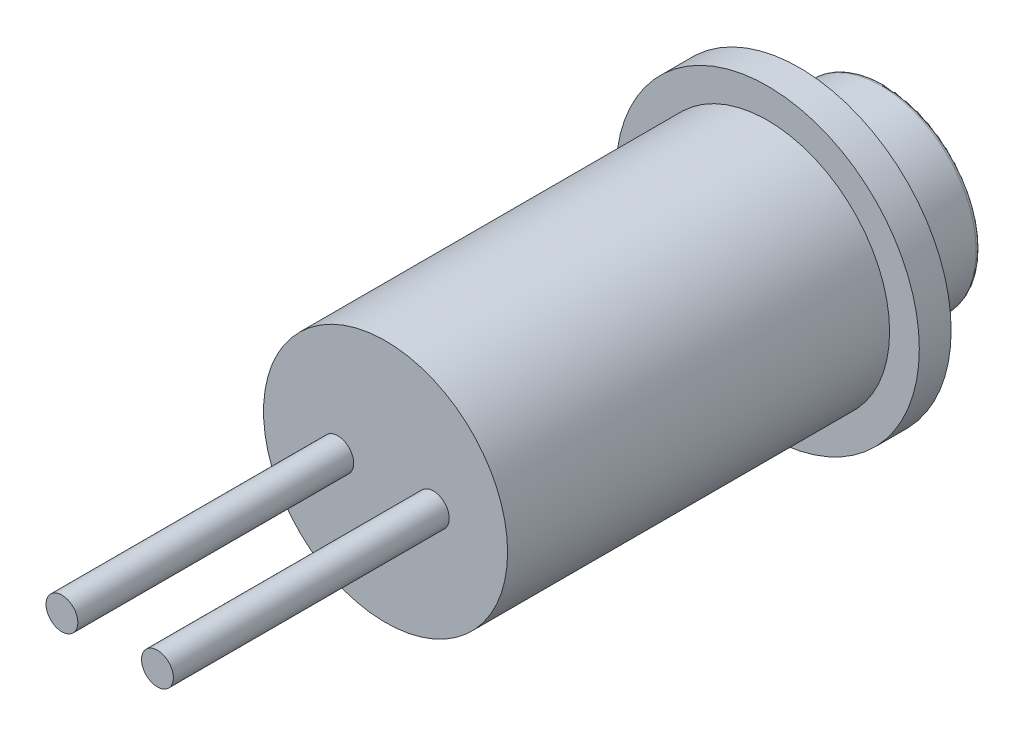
from build123d import *

# Parameters (mm, degrees)
ESQUISSE1_R        = 5.75
BOSS_EXTRU_1_DEPTH = 18
ESQUISSE2_R        = 7.15
BOSS_EXTRU_2_DEPTH = 2.5
CHANFREIN1_SIZE    = 1.5
CHANFREIN1_SIZE2   = 1
CONG_1_R           = 0.2
ESQUISSE4_R        = 0.75
BOSS_EXTRU_3_DEPTH = 13


with BuildPart() as part:
    # Esquisse1 → Boss.-Extru.1 (new body)
    with BuildSketch(Plane.XY):
        Circle(ESQUISSE1_R)
    extrude(amount=BOSS_EXTRU_1_DEPTH)

    # Esquisse2 → Boss.-Extru.2 (add)
    with BuildSketch(Plane.XY):
        Circle(ESQUISSE2_R)
    extrude(amount=-BOSS_EXTRU_2_DEPTH)

    # Chanfrein1
    chanfrein1_edges = [part.edges().sort_by_distance(p)[0] for p in [
        (-7.15, 0, -2.5),
    ]]
    chanfrein1_side = [part.faces().sort_by_distance(p)[0] for p in [
        (0, 0, -2.5),
    ]]
    chamfer(chanfrein1_edges, length=CHANFREIN1_SIZE, length2=CHANFREIN1_SIZE2, reference=chanfrein1_side[0])

    # Esquisse3 → R_volution1 (revolve)
    with BuildSketch(Plane(origin=(0, 0, 0), x_dir=(1, 0, 0), z_dir=(0, 1, 0)), mode=Mode.PRIVATE) as r_volution1_sk:
        with BuildLine():
            Line((0, 2.5), (-4.5, 2.5))
            Line((-4.5, 2.5), (-4.5, 5.5))
            ThreePointArc((-4.5, 5.5), (-2.259244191, 5.806041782), (0, 5.908334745))
            Line((0, 5.908334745), (0, 2.5))
        make_face()
    revolve(r_volution1_sk.sketch.rotate(Axis((0, 0, 0), (0, 0, -1)), 180), axis=Axis((0, 0, 0), (0, 0, -1)))

    # Cong_1
    cong_1_edges = [part.edges().sort_by_distance(p)[0] for p in [
        (-4.5, 0, -5.5),
    ]]
    fillet(cong_1_edges, radius=CONG_1_R)

    # Esquisse4 → Boss.-Extru.3 (add)
    with BuildSketch(Plane.XY.offset(18)):
        with Locations(Location((2.25, 0, 0), (0, 0, 180))):
            Circle(ESQUISSE4_R)
        with Locations(Location((-2.25, 0, 0), (0, 0, 180))):
            Circle(ESQUISSE4_R)
    extrude(amount=BOSS_EXTRU_3_DEPTH)


solid = part.part
